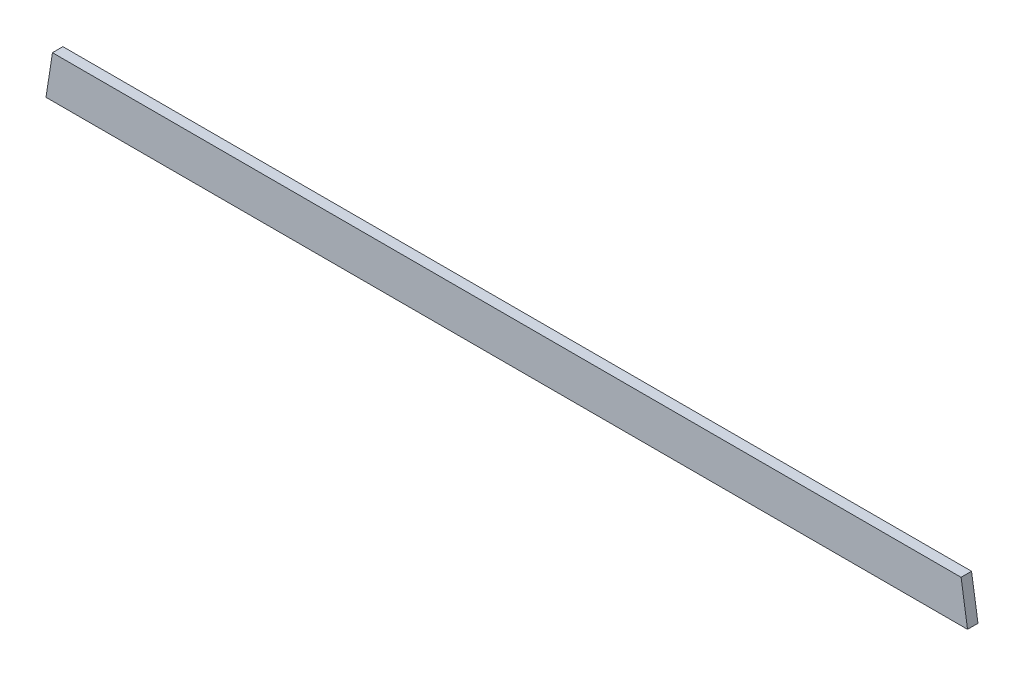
from build123d import *

# Parameters (mm, degrees)
BOSS_EXTRUDE1_DEPTH = 25.4


with BuildPart() as part:
    # Sketch2 → Boss-Extrude1 (new body)
    with BuildSketch(Plane.XY):
        Polygon((-1117.6, -1371.6), (1117.6, -1371.6), (1101.969230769, -1270), (-1101.969230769, -1270), align=None)
    extrude(amount=BOSS_EXTRUDE1_DEPTH)


solid = part.part
